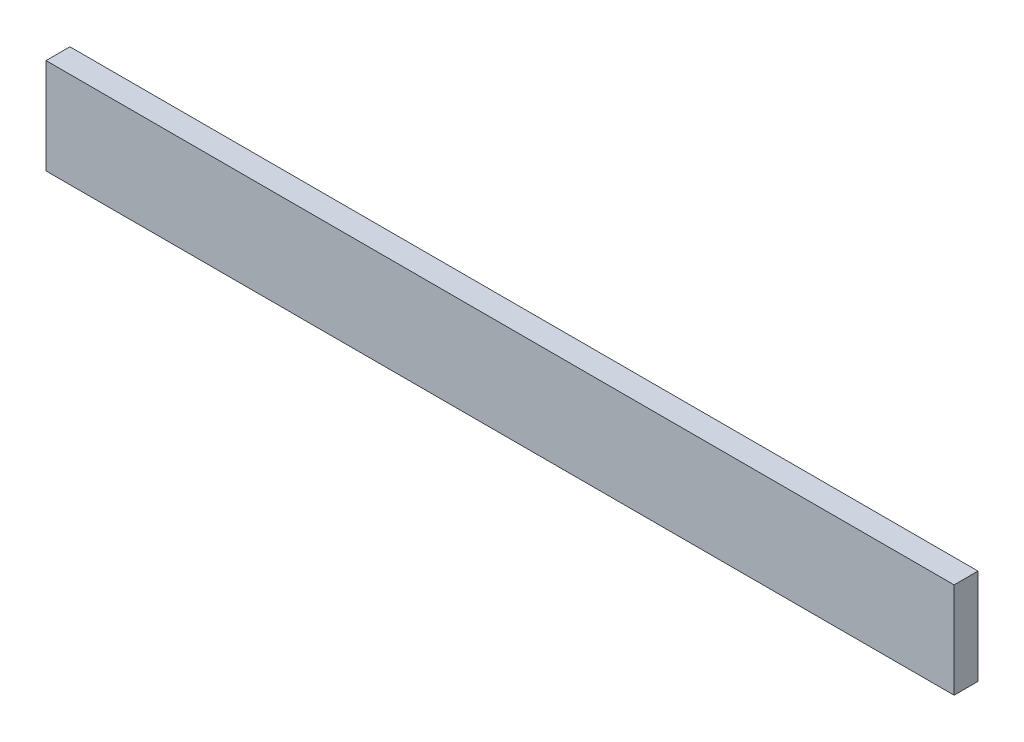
ISO-10303-21;
HEADER;
FILE_DESCRIPTION(('STEP AP214'),'2;1');
FILE_NAME('part.step','',(''),(''),'','','');
FILE_SCHEMA(('AUTOMOTIVE_DESIGN { 1 0 10303 214 1 1 1 1 }'));
ENDSEC;
DATA;
#1=APPLICATION_CONTEXT('core data for automotive mechanical design processes');
#2=APPLICATION_PROTOCOL_DEFINITION('international standard','automotive_design',2000,#1);
#3=PRODUCT_CONTEXT('',#1,'mechanical');
#4=PRODUCT('Part','Part','',(#3));
#5=PRODUCT_RELATED_PRODUCT_CATEGORY('part','',(#4));
#6=PRODUCT_DEFINITION_FORMATION('','',#4);
#7=PRODUCT_DEFINITION_CONTEXT('part definition',#1,'design');
#8=PRODUCT_DEFINITION('design','',#6,#7);
#9=PRODUCT_DEFINITION_SHAPE('','',#8);
#10=(LENGTH_UNIT() NAMED_UNIT(*) SI_UNIT(.MILLI.,.METRE.));
#11=(NAMED_UNIT(*) PLANE_ANGLE_UNIT() SI_UNIT($,.RADIAN.));
#12=(NAMED_UNIT(*) SI_UNIT($,.STERADIAN.) SOLID_ANGLE_UNIT());
#13=UNCERTAINTY_MEASURE_WITH_UNIT(LENGTH_MEASURE(1.E-05),#10,'distance_accuracy_value','');
#14=(GEOMETRIC_REPRESENTATION_CONTEXT(3) GLOBAL_UNCERTAINTY_ASSIGNED_CONTEXT((#13)) GLOBAL_UNIT_ASSIGNED_CONTEXT((#10,
#11,#12)) REPRESENTATION_CONTEXT('',''));
#15=CARTESIAN_POINT('',(0.,0.,0.));
#16=DIRECTION('',(0.,0.,1.));
#17=DIRECTION('',(1.,0.,0.));
#18=AXIS2_PLACEMENT_3D('',#15,#16,#17);
#19=CARTESIAN_POINT('',(237.5,-25.,12.5));
#20=DIRECTION('',(-1.,0.,0.));
#21=DIRECTION('',(0.,0.,1.));
#22=AXIS2_PLACEMENT_3D('',#19,#20,#21);
#23=PLANE('',#22);
#24=DIRECTION('',(0.,1.,0.));
#25=VECTOR('',#24,1.);
#26=CARTESIAN_POINT('',(237.5,-25.,0.));
#27=LINE('',#26,#25);
#28=CARTESIAN_POINT('',(237.5,-25.,0.));
#29=VERTEX_POINT('',#28);
#30=CARTESIAN_POINT('',(237.5,25.,0.));
#31=VERTEX_POINT('',#30);
#32=EDGE_CURVE('E96',#29,#31,#27,.T.);
#33=ORIENTED_EDGE('',*,*,#32,.T.);
#34=DIRECTION('',(0.,0.,-1.));
#35=VECTOR('',#34,1.);
#36=CARTESIAN_POINT('',(237.5,25.,12.5));
#37=LINE('',#36,#35);
#38=CARTESIAN_POINT('',(237.5,25.,12.5));
#39=VERTEX_POINT('',#38);
#40=EDGE_CURVE('E11',#39,#31,#37,.T.);
#41=ORIENTED_EDGE('',*,*,#40,.F.);
#42=DIRECTION('',(0.,1.,0.));
#43=VECTOR('',#42,1.);
#44=CARTESIAN_POINT('',(237.5,-25.,12.5));
#45=LINE('',#44,#43);
#46=CARTESIAN_POINT('',(237.5,-25.,12.5));
#47=VERTEX_POINT('',#46);
#48=EDGE_CURVE('E84',#47,#39,#45,.T.);
#49=ORIENTED_EDGE('',*,*,#48,.F.);
#50=DIRECTION('',(0.,0.,-1.));
#51=VECTOR('',#50,1.);
#52=CARTESIAN_POINT('',(237.5,-25.,12.5));
#53=LINE('',#52,#51);
#54=EDGE_CURVE('E92',#47,#29,#53,.T.);
#55=ORIENTED_EDGE('',*,*,#54,.T.);
#56=EDGE_LOOP('',(#33,#41,#49,#55));
#57=FACE_BOUND('',#56,.T.);
#58=ADVANCED_FACE('F33',(#57),#23,.F.);
#59=CARTESIAN_POINT('',(-237.5,25.,12.5));
#60=DIRECTION('',(0.,-1.,0.));
#61=DIRECTION('',(0.,0.,-1.));
#62=AXIS2_PLACEMENT_3D('',#59,#60,#61);
#63=PLANE('',#62);
#64=DIRECTION('',(-1.,0.,0.));
#65=VECTOR('',#64,1.);
#66=CARTESIAN_POINT('',(-237.5,25.,0.));
#67=LINE('',#66,#65);
#68=CARTESIAN_POINT('',(-237.5,25.,0.));
#69=VERTEX_POINT('',#68);
#70=EDGE_CURVE('E88',#31,#69,#67,.T.);
#71=ORIENTED_EDGE('',*,*,#70,.T.);
#72=DIRECTION('',(0.,0.,-1.));
#73=VECTOR('',#72,1.);
#74=CARTESIAN_POINT('',(-237.5,25.,12.5));
#75=LINE('',#74,#73);
#76=CARTESIAN_POINT('',(-237.5,25.,12.5));
#77=VERTEX_POINT('',#76);
#78=EDGE_CURVE('E41',#77,#69,#75,.T.);
#79=ORIENTED_EDGE('',*,*,#78,.F.);
#80=DIRECTION('',(-1.,0.,0.));
#81=VECTOR('',#80,1.);
#82=CARTESIAN_POINT('',(-237.5,25.,12.5));
#83=LINE('',#82,#81);
#84=EDGE_CURVE('E79',#39,#77,#83,.T.);
#85=ORIENTED_EDGE('',*,*,#84,.F.);
#86=ORIENTED_EDGE('',*,*,#40,.T.);
#87=EDGE_LOOP('',(#71,#79,#85,#86));
#88=FACE_BOUND('',#87,.T.);
#89=ADVANCED_FACE('F87',(#88),#63,.F.);
#90=CARTESIAN_POINT('',(-237.5,-25.,12.5));
#91=DIRECTION('',(1.,0.,0.));
#92=DIRECTION('',(0.,0.,-1.));
#93=AXIS2_PLACEMENT_3D('',#90,#91,#92);
#94=PLANE('',#93);
#95=DIRECTION('',(0.,-1.,0.));
#96=VECTOR('',#95,1.);
#97=CARTESIAN_POINT('',(-237.5,-25.,0.));
#98=LINE('',#97,#96);
#99=CARTESIAN_POINT('',(-237.5,-25.,0.));
#100=VERTEX_POINT('',#99);
#101=EDGE_CURVE('E66',#69,#100,#98,.T.);
#102=ORIENTED_EDGE('',*,*,#101,.T.);
#103=DIRECTION('',(0.,0.,-1.));
#104=VECTOR('',#103,1.);
#105=CARTESIAN_POINT('',(-237.5,-25.,12.5));
#106=LINE('',#105,#104);
#107=CARTESIAN_POINT('',(-237.5,-25.,12.5));
#108=VERTEX_POINT('',#107);
#109=EDGE_CURVE('E89',#108,#100,#106,.T.);
#110=ORIENTED_EDGE('',*,*,#109,.F.);
#111=DIRECTION('',(0.,-1.,0.));
#112=VECTOR('',#111,1.);
#113=CARTESIAN_POINT('',(-237.5,-25.,12.5));
#114=LINE('',#113,#112);
#115=EDGE_CURVE('E82',#77,#108,#114,.T.);
#116=ORIENTED_EDGE('',*,*,#115,.F.);
#117=ORIENTED_EDGE('',*,*,#78,.T.);
#118=EDGE_LOOP('',(#102,#110,#116,#117));
#119=FACE_BOUND('',#118,.T.);
#120=ADVANCED_FACE('F90',(#119),#94,.F.);
#121=CARTESIAN_POINT('',(-237.5,-25.,12.5));
#122=DIRECTION('',(0.,1.,0.));
#123=DIRECTION('',(0.,0.,1.));
#124=AXIS2_PLACEMENT_3D('',#121,#122,#123);
#125=PLANE('',#124);
#126=DIRECTION('',(1.,0.,0.));
#127=VECTOR('',#126,1.);
#128=CARTESIAN_POINT('',(-237.5,-25.,0.));
#129=LINE('',#128,#127);
#130=EDGE_CURVE('E72',#100,#29,#129,.T.);
#131=ORIENTED_EDGE('',*,*,#130,.T.);
#132=ORIENTED_EDGE('',*,*,#54,.F.);
#133=DIRECTION('',(1.,0.,0.));
#134=VECTOR('',#133,1.);
#135=CARTESIAN_POINT('',(-237.5,-25.,12.5));
#136=LINE('',#135,#134);
#137=EDGE_CURVE('E49',#108,#47,#136,.T.);
#138=ORIENTED_EDGE('',*,*,#137,.F.);
#139=ORIENTED_EDGE('',*,*,#109,.T.);
#140=EDGE_LOOP('',(#131,#132,#138,#139));
#141=FACE_BOUND('',#140,.T.);
#142=ADVANCED_FACE('F103',(#141),#125,.F.);
#143=CARTESIAN_POINT('',(0.,0.,12.5));
#144=DIRECTION('',(0.,0.,-1.));
#145=DIRECTION('',(-1.,0.,0.));
#146=AXIS2_PLACEMENT_3D('',#143,#144,#145);
#147=PLANE('',#146);
#148=ORIENTED_EDGE('',*,*,#48,.T.);
#149=ORIENTED_EDGE('',*,*,#84,.T.);
#150=ORIENTED_EDGE('',*,*,#115,.T.);
#151=ORIENTED_EDGE('',*,*,#137,.T.);
#152=EDGE_LOOP('',(#148,#149,#150,#151));
#153=FACE_BOUND('',#152,.T.);
#154=ADVANCED_FACE('F80',(#153),#147,.F.);
#155=CARTESIAN_POINT('',(0.,0.,0.));
#156=DIRECTION('',(0.,0.,-1.));
#157=DIRECTION('',(-1.,0.,0.));
#158=AXIS2_PLACEMENT_3D('',#155,#156,#157);
#159=PLANE('',#158);
#160=ORIENTED_EDGE('',*,*,#32,.F.);
#161=ORIENTED_EDGE('',*,*,#130,.F.);
#162=ORIENTED_EDGE('',*,*,#101,.F.);
#163=ORIENTED_EDGE('',*,*,#70,.F.);
#164=EDGE_LOOP('',(#160,#161,#162,#163));
#165=FACE_BOUND('',#164,.T.);
#166=ADVANCED_FACE('F106',(#165),#159,.T.);
#167=CLOSED_SHELL('',(#58,#89,#120,#142,#154,#166));
#168=MANIFOLD_SOLID_BREP('B2',#167);
#169=ADVANCED_BREP_SHAPE_REPRESENTATION('',(#18,#168),#14);
#170=SHAPE_DEFINITION_REPRESENTATION(#9,#169);
ENDSEC;
END-ISO-10303-21;
